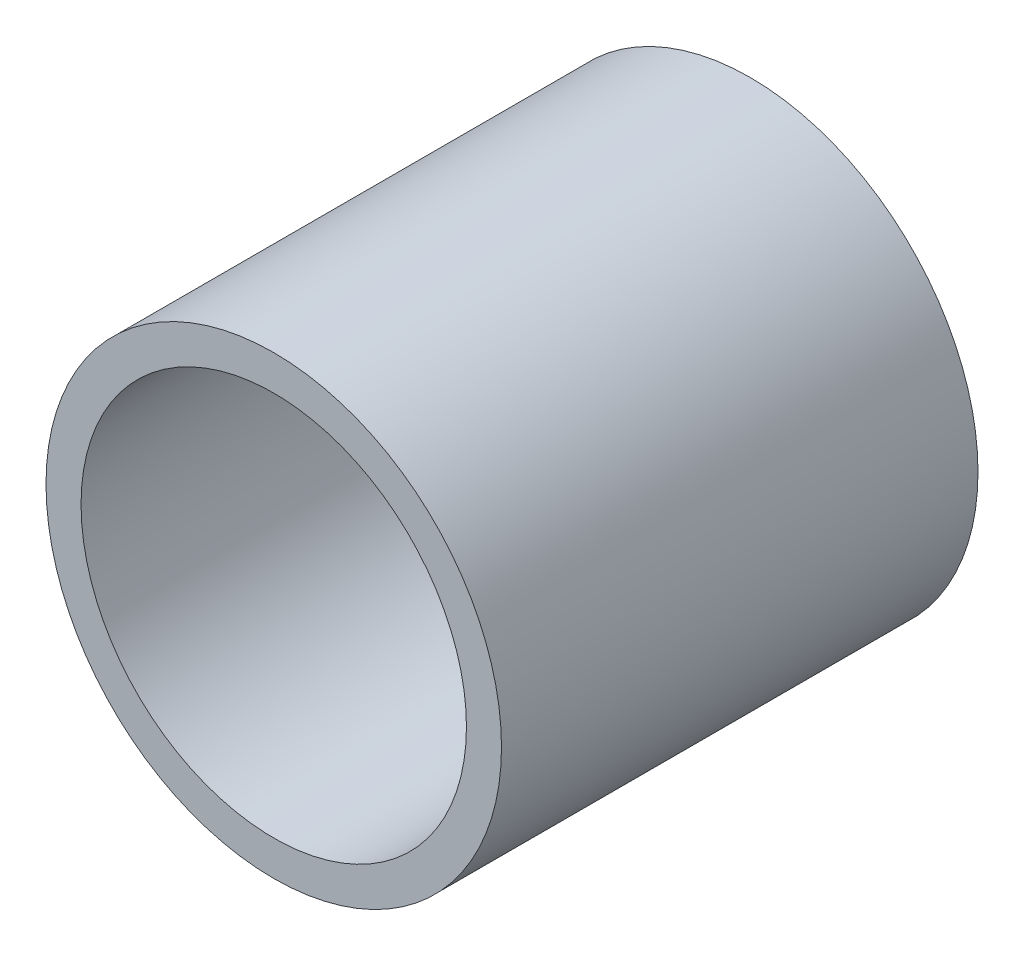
from build123d import *

# Parameters (mm, degrees)
ESQUISSE1_R             = 6.5
BASE_EXTRUSION_DEPTH    = 13.6
ESQUISSE2_R             = 5.5
ENL_V_MAT_EXTRU_1_DEPTH = 14


with BuildPart() as part:
    # Esquisse1 → Base-Extrusion (new body)
    with BuildSketch(Plane.XY):
        Circle(ESQUISSE1_R)
    extrude(amount=BASE_EXTRUSION_DEPTH)

    # Esquisse2 → Enl_v. mat.-Extru.1 (cut)
    with BuildSketch(Plane.XY.offset(13.6)):
        Circle(ESQUISSE2_R)
    extrude(amount=-ENL_V_MAT_EXTRU_1_DEPTH, mode=Mode.SUBTRACT)


solid = part.part
